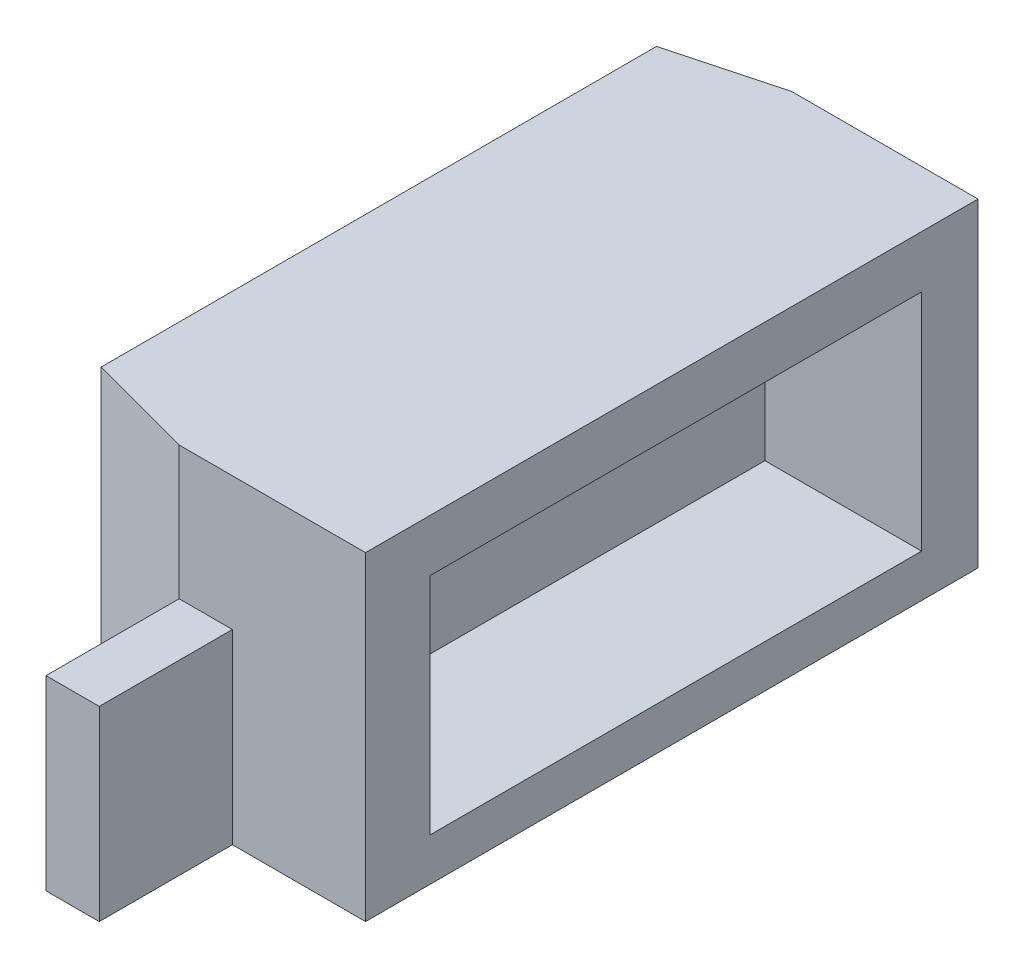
ISO-10303-21;
HEADER;
FILE_DESCRIPTION(('STEP AP214'),'2;1');
FILE_NAME('part.step','',(''),(''),'','','');
FILE_SCHEMA(('AUTOMOTIVE_DESIGN { 1 0 10303 214 1 1 1 1 }'));
ENDSEC;
DATA;
#1=APPLICATION_CONTEXT('core data for automotive mechanical design processes');
#2=APPLICATION_PROTOCOL_DEFINITION('international standard','automotive_design',2000,#1);
#3=PRODUCT_CONTEXT('',#1,'mechanical');
#4=PRODUCT('Part','Part','',(#3));
#5=PRODUCT_RELATED_PRODUCT_CATEGORY('part','',(#4));
#6=PRODUCT_DEFINITION_FORMATION('','',#4);
#7=PRODUCT_DEFINITION_CONTEXT('part definition',#1,'design');
#8=PRODUCT_DEFINITION('design','',#6,#7);
#9=PRODUCT_DEFINITION_SHAPE('','',#8);
#10=(LENGTH_UNIT() NAMED_UNIT(*) SI_UNIT(.MILLI.,.METRE.));
#11=(NAMED_UNIT(*) PLANE_ANGLE_UNIT() SI_UNIT($,.RADIAN.));
#12=(NAMED_UNIT(*) SI_UNIT($,.STERADIAN.) SOLID_ANGLE_UNIT());
#13=UNCERTAINTY_MEASURE_WITH_UNIT(LENGTH_MEASURE(1.E-05),#10,'distance_accuracy_value','');
#14=(GEOMETRIC_REPRESENTATION_CONTEXT(3) GLOBAL_UNCERTAINTY_ASSIGNED_CONTEXT((#13)) GLOBAL_UNIT_ASSIGNED_CONTEXT((#10,
#11,#12)) REPRESENTATION_CONTEXT('',''));
#15=CARTESIAN_POINT('',(0.,0.,0.));
#16=DIRECTION('',(0.,0.,1.));
#17=DIRECTION('',(1.,0.,0.));
#18=AXIS2_PLACEMENT_3D('',#15,#16,#17);
#19=CARTESIAN_POINT('',(-0.55,1.2,-1.15));
#20=DIRECTION('',(0.,0.,1.));
#21=DIRECTION('',(1.,0.,0.));
#22=AXIS2_PLACEMENT_3D('',#19,#20,#21);
#23=PLANE('',#22);
#24=DIRECTION('',(-1.,0.,0.));
#25=VECTOR('',#24,1.);
#26=CARTESIAN_POINT('',(-0.15,0.7,-1.15));
#27=LINE('',#26,#25);
#28=CARTESIAN_POINT('',(0.0499999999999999,0.7,-1.15));
#29=VERTEX_POINT('',#28);
#30=CARTESIAN_POINT('',(-0.15,0.7,-1.15));
#31=VERTEX_POINT('',#30);
#32=EDGE_CURVE('E192',#29,#31,#27,.T.);
#33=ORIENTED_EDGE('',*,*,#32,.T.);
#34=DIRECTION('',(0.,1.,0.));
#35=VECTOR('',#34,1.);
#36=CARTESIAN_POINT('',(-0.149999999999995,1.2,-1.15));
#37=LINE('',#36,#35);
#38=CARTESIAN_POINT('',(-0.149999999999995,1.2,-1.15));
#39=VERTEX_POINT('',#38);
#40=EDGE_CURVE('E11',#31,#39,#37,.T.);
#41=ORIENTED_EDGE('',*,*,#40,.T.);
#42=DIRECTION('',(-1.,0.,0.));
#43=VECTOR('',#42,1.);
#44=CARTESIAN_POINT('',(-0.55,1.2,-1.15));
#45=LINE('',#44,#43);
#46=CARTESIAN_POINT('',(0.55,1.2,-1.15));
#47=VERTEX_POINT('',#46);
#48=EDGE_CURVE('E325',#47,#39,#45,.T.);
#49=ORIENTED_EDGE('',*,*,#48,.F.);
#50=DIRECTION('',(0.,-1.,0.));
#51=VECTOR('',#50,1.);
#52=CARTESIAN_POINT('',(0.55,1.2,-1.15));
#53=LINE('',#52,#51);
#54=CARTESIAN_POINT('',(0.55,0.,-1.15));
#55=VERTEX_POINT('',#54);
#56=EDGE_CURVE('E235',#47,#55,#53,.T.);
#57=ORIENTED_EDGE('',*,*,#56,.T.);
#58=DIRECTION('',(-1.,0.,0.));
#59=VECTOR('',#58,1.);
#60=CARTESIAN_POINT('',(-0.55,0.,-1.15));
#61=LINE('',#60,#59);
#62=CARTESIAN_POINT('',(0.0499999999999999,0.,-1.15));
#63=VERTEX_POINT('',#62);
#64=EDGE_CURVE('E291',#55,#63,#61,.T.);
#65=ORIENTED_EDGE('',*,*,#64,.T.);
#66=DIRECTION('',(0.,-1.,0.));
#67=VECTOR('',#66,1.);
#68=CARTESIAN_POINT('',(0.0499999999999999,0.7,-1.15));
#69=LINE('',#68,#67);
#70=EDGE_CURVE('E209',#29,#63,#69,.T.);
#71=ORIENTED_EDGE('',*,*,#70,.F.);
#72=EDGE_LOOP('',(#33,#41,#49,#57,#65,#71));
#73=FACE_BOUND('',#72,.T.);
#74=ADVANCED_FACE('F32',(#73),#23,.F.);
#75=CARTESIAN_POINT('',(-0.55,1.2,1.15));
#76=DIRECTION('',(0.,0.,-1.));
#77=DIRECTION('',(-1.,0.,0.));
#78=AXIS2_PLACEMENT_3D('',#75,#76,#77);
#79=PLANE('',#78);
#80=DIRECTION('',(1.,0.,0.));
#81=VECTOR('',#80,1.);
#82=CARTESIAN_POINT('',(-0.55,1.2,1.15));
#83=LINE('',#82,#81);
#84=CARTESIAN_POINT('',(-0.149999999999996,1.2,1.15));
#85=VERTEX_POINT('',#84);
#86=CARTESIAN_POINT('',(0.55,1.2,1.15));
#87=VERTEX_POINT('',#86);
#88=EDGE_CURVE('E253',#85,#87,#83,.T.);
#89=ORIENTED_EDGE('',*,*,#88,.F.);
#90=DIRECTION('',(0.,-1.,0.));
#91=VECTOR('',#90,1.);
#92=CARTESIAN_POINT('',(-0.149999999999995,1.2,1.15));
#93=LINE('',#92,#91);
#94=CARTESIAN_POINT('',(-0.15,0.7,1.15));
#95=VERTEX_POINT('',#94);
#96=EDGE_CURVE('E231',#85,#95,#93,.T.);
#97=ORIENTED_EDGE('',*,*,#96,.T.);
#98=DIRECTION('',(1.,0.,0.));
#99=VECTOR('',#98,1.);
#100=CARTESIAN_POINT('',(-0.15,0.7,1.15));
#101=LINE('',#100,#99);
#102=CARTESIAN_POINT('',(0.0499999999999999,0.7,1.15));
#103=VERTEX_POINT('',#102);
#104=EDGE_CURVE('E316',#95,#103,#101,.T.);
#105=ORIENTED_EDGE('',*,*,#104,.T.);
#106=DIRECTION('',(0.,-1.,0.));
#107=VECTOR('',#106,1.);
#108=CARTESIAN_POINT('',(0.0499999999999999,0.7,1.15));
#109=LINE('',#108,#107);
#110=CARTESIAN_POINT('',(0.0499999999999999,0.,1.15));
#111=VERTEX_POINT('',#110);
#112=EDGE_CURVE('E273',#103,#111,#109,.T.);
#113=ORIENTED_EDGE('',*,*,#112,.T.);
#114=DIRECTION('',(1.,0.,0.));
#115=VECTOR('',#114,1.);
#116=CARTESIAN_POINT('',(-0.55,0.,1.15));
#117=LINE('',#116,#115);
#118=CARTESIAN_POINT('',(0.55,0.,1.15));
#119=VERTEX_POINT('',#118);
#120=EDGE_CURVE('E300',#111,#119,#117,.T.);
#121=ORIENTED_EDGE('',*,*,#120,.T.);
#122=DIRECTION('',(0.,-1.,0.));
#123=VECTOR('',#122,1.);
#124=CARTESIAN_POINT('',(0.55,1.2,1.15));
#125=LINE('',#124,#123);
#126=EDGE_CURVE('E263',#87,#119,#125,.T.);
#127=ORIENTED_EDGE('',*,*,#126,.F.);
#128=EDGE_LOOP('',(#89,#97,#105,#113,#121,#127));
#129=FACE_BOUND('',#128,.T.);
#130=ADVANCED_FACE('F259',(#129),#79,.F.);
#131=CARTESIAN_POINT('',(0.55,1.2,1.15));
#132=DIRECTION('',(-1.,0.,0.));
#133=DIRECTION('',(0.,0.,1.));
#134=AXIS2_PLACEMENT_3D('',#131,#132,#133);
#135=PLANE('',#134);
#136=DIRECTION('',(0.,0.,-1.));
#137=VECTOR('',#136,1.);
#138=CARTESIAN_POINT('',(0.55,0.160896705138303,0.908093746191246));
#139=LINE('',#138,#137);
#140=CARTESIAN_POINT('',(0.55,0.160896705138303,0.908093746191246));
#141=VERTEX_POINT('',#140);
#142=CARTESIAN_POINT('',(0.55,0.160896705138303,-0.93803090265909));
#143=VERTEX_POINT('',#142);
#144=EDGE_CURVE('E168',#141,#143,#139,.T.);
#145=ORIENTED_EDGE('',*,*,#144,.F.);
#146=DIRECTION('',(0.,-1.,0.));
#147=VECTOR('',#146,1.);
#148=CARTESIAN_POINT('',(0.55,1.00412661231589,0.908093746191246));
#149=LINE('',#148,#147);
#150=CARTESIAN_POINT('',(0.55,1.00412661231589,0.908093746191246));
#151=VERTEX_POINT('',#150);
#152=EDGE_CURVE('E172',#151,#141,#149,.T.);
#153=ORIENTED_EDGE('',*,*,#152,.F.);
#154=DIRECTION('',(0.,0.,1.));
#155=VECTOR('',#154,1.);
#156=CARTESIAN_POINT('',(0.55,1.00412661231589,0.908093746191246));
#157=LINE('',#156,#155);
#158=CARTESIAN_POINT('',(0.55,1.00412661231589,-0.93803090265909));
#159=VERTEX_POINT('',#158);
#160=EDGE_CURVE('E177',#159,#151,#157,.T.);
#161=ORIENTED_EDGE('',*,*,#160,.F.);
#162=DIRECTION('',(0.,1.,0.));
#163=VECTOR('',#162,1.);
#164=CARTESIAN_POINT('',(0.55,1.00412661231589,-0.93803090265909));
#165=LINE('',#164,#163);
#166=EDGE_CURVE('E156',#143,#159,#165,.T.);
#167=ORIENTED_EDGE('',*,*,#166,.F.);
#168=EDGE_LOOP('',(#145,#153,#161,#167));
#169=FACE_BOUND('',#168,.T.);
#170=DIRECTION('',(0.,0.,-1.));
#171=VECTOR('',#170,1.);
#172=CARTESIAN_POINT('',(0.55,0.,1.15));
#173=LINE('',#172,#171);
#174=EDGE_CURVE('E295',#119,#55,#173,.T.);
#175=ORIENTED_EDGE('',*,*,#174,.T.);
#176=ORIENTED_EDGE('',*,*,#56,.F.);
#177=DIRECTION('',(0.,0.,-1.));
#178=VECTOR('',#177,1.);
#179=CARTESIAN_POINT('',(0.55,1.2,1.15));
#180=LINE('',#179,#178);
#181=EDGE_CURVE('E306',#87,#47,#180,.T.);
#182=ORIENTED_EDGE('',*,*,#181,.F.);
#183=ORIENTED_EDGE('',*,*,#126,.T.);
#184=EDGE_LOOP('',(#175,#176,#182,#183));
#185=FACE_BOUND('',#184,.T.);
#186=ADVANCED_FACE('F174',(#169,#185),#135,.F.);
#187=CARTESIAN_POINT('',(-0.55,1.2,1.15));
#188=DIRECTION('',(1.,0.,0.));
#189=DIRECTION('',(0.,0.,-1.));
#190=AXIS2_PLACEMENT_3D('',#187,#188,#189);
#191=PLANE('',#190);
#192=DIRECTION('',(0.,0.,1.));
#193=VECTOR('',#192,1.);
#194=CARTESIAN_POINT('',(-0.55,0.,1.15));
#195=LINE('',#194,#193);
#196=CARTESIAN_POINT('',(-0.55,0.,-1.04282032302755));
#197=VERTEX_POINT('',#196);
#198=CARTESIAN_POINT('',(-0.55,0.,1.04282032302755));
#199=VERTEX_POINT('',#198);
#200=EDGE_CURVE('E294',#197,#199,#195,.T.);
#201=ORIENTED_EDGE('',*,*,#200,.T.);
#202=DIRECTION('',(0.,1.,0.));
#203=VECTOR('',#202,1.);
#204=CARTESIAN_POINT('',(-0.55,1.2,1.04282032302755));
#205=LINE('',#204,#203);
#206=CARTESIAN_POINT('',(-0.55,1.2,1.04282032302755));
#207=VERTEX_POINT('',#206);
#208=EDGE_CURVE('E53',#199,#207,#205,.T.);
#209=ORIENTED_EDGE('',*,*,#208,.T.);
#210=DIRECTION('',(0.,0.,1.));
#211=VECTOR('',#210,1.);
#212=CARTESIAN_POINT('',(-0.55,1.2,1.15));
#213=LINE('',#212,#211);
#214=CARTESIAN_POINT('',(-0.55,1.2,-1.04282032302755));
#215=VERTEX_POINT('',#214);
#216=EDGE_CURVE('E255',#215,#207,#213,.T.);
#217=ORIENTED_EDGE('',*,*,#216,.F.);
#218=DIRECTION('',(0.,-1.,0.));
#219=VECTOR('',#218,1.);
#220=CARTESIAN_POINT('',(-0.55,1.2,-1.04282032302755));
#221=LINE('',#220,#219);
#222=EDGE_CURVE('E241',#215,#197,#221,.T.);
#223=ORIENTED_EDGE('',*,*,#222,.T.);
#224=EDGE_LOOP('',(#201,#209,#217,#223));
#225=FACE_BOUND('',#224,.T.);
#226=ADVANCED_FACE('F333',(#225),#191,.F.);
#227=CARTESIAN_POINT('',(0.55,1.2,-1.15));
#228=DIRECTION('',(0.,-1.,0.));
#229=DIRECTION('',(0.,0.,-1.));
#230=AXIS2_PLACEMENT_3D('',#227,#228,#229);
#231=PLANE('',#230);
#232=ORIENTED_EDGE('',*,*,#216,.T.);
#233=DIRECTION('',(-0.965925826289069,0.,-0.258819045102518));
#234=VECTOR('',#233,1.);
#235=CARTESIAN_POINT('',(-0.149999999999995,1.2,1.15));
#236=LINE('',#235,#234);
#237=EDGE_CURVE('E40',#207,#85,#236,.F.);
#238=ORIENTED_EDGE('',*,*,#237,.T.);
#239=ORIENTED_EDGE('',*,*,#88,.T.);
#240=ORIENTED_EDGE('',*,*,#181,.T.);
#241=ORIENTED_EDGE('',*,*,#48,.T.);
#242=DIRECTION('',(0.965925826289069,0.,-0.258819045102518));
#243=VECTOR('',#242,1.);
#244=CARTESIAN_POINT('',(-0.55,1.2,-1.04282032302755));
#245=LINE('',#244,#243);
#246=EDGE_CURVE('E247',#39,#215,#245,.F.);
#247=ORIENTED_EDGE('',*,*,#246,.T.);
#248=EDGE_LOOP('',(#232,#238,#239,#240,#241,#247));
#249=FACE_BOUND('',#248,.T.);
#250=ADVANCED_FACE('F251',(#249),#231,.F.);
#251=CARTESIAN_POINT('',(0.55,0.,-1.15));
#252=DIRECTION('',(0.,-1.,0.));
#253=DIRECTION('',(0.,0.,-1.));
#254=AXIS2_PLACEMENT_3D('',#251,#252,#253);
#255=PLANE('',#254);
#256=DIRECTION('',(0.,0.,-1.));
#257=VECTOR('',#256,1.);
#258=CARTESIAN_POINT('',(-0.15,0.,1.15));
#259=LINE('',#258,#257);
#260=CARTESIAN_POINT('',(-0.15,0.,1.65));
#261=VERTEX_POINT('',#260);
#262=CARTESIAN_POINT('',(-0.15,0.,1.15));
#263=VERTEX_POINT('',#262);
#264=EDGE_CURVE('E208',#261,#263,#259,.T.);
#265=ORIENTED_EDGE('',*,*,#264,.T.);
#266=DIRECTION('',(0.965925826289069,0.,0.258819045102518));
#267=VECTOR('',#266,1.);
#268=CARTESIAN_POINT('',(-0.0718911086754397,0.,1.17092921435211));
#269=LINE('',#268,#267);
#270=EDGE_CURVE('E237',#263,#199,#269,.F.);
#271=ORIENTED_EDGE('',*,*,#270,.T.);
#272=ORIENTED_EDGE('',*,*,#200,.F.);
#273=DIRECTION('',(-0.965925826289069,0.,0.258819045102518));
#274=VECTOR('',#273,1.);
#275=CARTESIAN_POINT('',(0.503108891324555,0.,-1.325));
#276=LINE('',#275,#274);
#277=CARTESIAN_POINT('',(-0.15,0.,-1.15));
#278=VERTEX_POINT('',#277);
#279=EDGE_CURVE('E234',#197,#278,#276,.F.);
#280=ORIENTED_EDGE('',*,*,#279,.T.);
#281=DIRECTION('',(0.,0.,-1.));
#282=VECTOR('',#281,1.);
#283=CARTESIAN_POINT('',(-0.15,0.,-1.15));
#284=LINE('',#283,#282);
#285=CARTESIAN_POINT('',(-0.15,0.,-1.65));
#286=VERTEX_POINT('',#285);
#287=EDGE_CURVE('E198',#278,#286,#284,.T.);
#288=ORIENTED_EDGE('',*,*,#287,.T.);
#289=DIRECTION('',(1.,0.,0.));
#290=VECTOR('',#289,1.);
#291=CARTESIAN_POINT('',(-0.15,0.,-1.65));
#292=LINE('',#291,#290);
#293=CARTESIAN_POINT('',(0.05,0.,-1.65));
#294=VERTEX_POINT('',#293);
#295=EDGE_CURVE('E195',#286,#294,#292,.T.);
#296=ORIENTED_EDGE('',*,*,#295,.T.);
#297=DIRECTION('',(0.,0.,1.));
#298=VECTOR('',#297,1.);
#299=CARTESIAN_POINT('',(0.0499999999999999,0.,-1.15));
#300=LINE('',#299,#298);
#301=EDGE_CURVE('E187',#294,#63,#300,.T.);
#302=ORIENTED_EDGE('',*,*,#301,.T.);
#303=ORIENTED_EDGE('',*,*,#64,.F.);
#304=ORIENTED_EDGE('',*,*,#174,.F.);
#305=ORIENTED_EDGE('',*,*,#120,.F.);
#306=DIRECTION('',(0.,0.,1.));
#307=VECTOR('',#306,1.);
#308=CARTESIAN_POINT('',(0.0499999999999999,0.,1.15));
#309=LINE('',#308,#307);
#310=CARTESIAN_POINT('',(0.0499999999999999,0.,1.65));
#311=VERTEX_POINT('',#310);
#312=EDGE_CURVE('E288',#111,#311,#309,.T.);
#313=ORIENTED_EDGE('',*,*,#312,.T.);
#314=DIRECTION('',(-1.,0.,0.));
#315=VECTOR('',#314,1.);
#316=CARTESIAN_POINT('',(-0.15,0.,1.65));
#317=LINE('',#316,#315);
#318=EDGE_CURVE('E308',#311,#261,#317,.T.);
#319=ORIENTED_EDGE('',*,*,#318,.T.);
#320=EDGE_LOOP('',(#265,#271,#272,#280,#288,#296,#302,#303,#304,#305,#313,#319));
#321=FACE_BOUND('',#320,.T.);
#322=ADVANCED_FACE('F334',(#321),#255,.T.);
#323=CARTESIAN_POINT('',(-0.15,0.7,1.15));
#324=DIRECTION('',(-1.,0.,0.));
#325=DIRECTION('',(0.,0.,1.));
#326=AXIS2_PLACEMENT_3D('',#323,#324,#325);
#327=PLANE('',#326);
#328=ORIENTED_EDGE('',*,*,#264,.F.);
#329=DIRECTION('',(0.,-1.,0.));
#330=VECTOR('',#329,1.);
#331=CARTESIAN_POINT('',(-0.15,0.7,1.65));
#332=LINE('',#331,#330);
#333=CARTESIAN_POINT('',(-0.15,0.7,1.65));
#334=VERTEX_POINT('',#333);
#335=EDGE_CURVE('E320',#334,#261,#332,.T.);
#336=ORIENTED_EDGE('',*,*,#335,.F.);
#337=DIRECTION('',(0.,0.,-1.));
#338=VECTOR('',#337,1.);
#339=CARTESIAN_POINT('',(-0.15,0.7,1.15));
#340=LINE('',#339,#338);
#341=EDGE_CURVE('E314',#334,#95,#340,.T.);
#342=ORIENTED_EDGE('',*,*,#341,.T.);
#343=DIRECTION('',(0.,-1.,0.));
#344=VECTOR('',#343,1.);
#345=CARTESIAN_POINT('',(-0.15,0.7,1.15));
#346=LINE('',#345,#344);
#347=EDGE_CURVE('E268',#95,#263,#346,.T.);
#348=ORIENTED_EDGE('',*,*,#347,.T.);
#349=EDGE_LOOP('',(#328,#336,#342,#348));
#350=FACE_BOUND('',#349,.T.);
#351=ADVANCED_FACE('F337',(#350),#327,.T.);
#352=CARTESIAN_POINT('',(-0.15,0.7,1.65));
#353=DIRECTION('',(0.,0.,1.));
#354=DIRECTION('',(1.,0.,0.));
#355=AXIS2_PLACEMENT_3D('',#352,#353,#354);
#356=PLANE('',#355);
#357=ORIENTED_EDGE('',*,*,#318,.F.);
#358=DIRECTION('',(0.,-1.,0.));
#359=VECTOR('',#358,1.);
#360=CARTESIAN_POINT('',(0.0499999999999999,0.7,1.65));
#361=LINE('',#360,#359);
#362=CARTESIAN_POINT('',(0.0499999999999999,0.7,1.65));
#363=VERTEX_POINT('',#362);
#364=EDGE_CURVE('E277',#363,#311,#361,.T.);
#365=ORIENTED_EDGE('',*,*,#364,.F.);
#366=DIRECTION('',(-1.,0.,0.));
#367=VECTOR('',#366,1.);
#368=CARTESIAN_POINT('',(-0.15,0.7,1.65));
#369=LINE('',#368,#367);
#370=EDGE_CURVE('E274',#363,#334,#369,.T.);
#371=ORIENTED_EDGE('',*,*,#370,.T.);
#372=ORIENTED_EDGE('',*,*,#335,.T.);
#373=EDGE_LOOP('',(#357,#365,#371,#372));
#374=FACE_BOUND('',#373,.T.);
#375=ADVANCED_FACE('F344',(#374),#356,.T.);
#376=CARTESIAN_POINT('',(0.0499999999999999,0.7,1.15));
#377=DIRECTION('',(1.,0.,0.));
#378=DIRECTION('',(0.,0.,-1.));
#379=AXIS2_PLACEMENT_3D('',#376,#377,#378);
#380=PLANE('',#379);
#381=ORIENTED_EDGE('',*,*,#312,.F.);
#382=ORIENTED_EDGE('',*,*,#112,.F.);
#383=DIRECTION('',(0.,0.,1.));
#384=VECTOR('',#383,1.);
#385=CARTESIAN_POINT('',(0.0499999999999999,0.7,1.15));
#386=LINE('',#385,#384);
#387=EDGE_CURVE('E280',#103,#363,#386,.T.);
#388=ORIENTED_EDGE('',*,*,#387,.T.);
#389=ORIENTED_EDGE('',*,*,#364,.T.);
#390=EDGE_LOOP('',(#381,#382,#388,#389));
#391=FACE_BOUND('',#390,.T.);
#392=ADVANCED_FACE('F347',(#391),#380,.T.);
#393=CARTESIAN_POINT('',(-0.15,0.7,1.65));
#394=DIRECTION('',(0.,1.,0.));
#395=DIRECTION('',(0.,0.,1.));
#396=AXIS2_PLACEMENT_3D('',#393,#394,#395);
#397=PLANE('',#396);
#398=ORIENTED_EDGE('',*,*,#341,.F.);
#399=ORIENTED_EDGE('',*,*,#370,.F.);
#400=ORIENTED_EDGE('',*,*,#387,.F.);
#401=ORIENTED_EDGE('',*,*,#104,.F.);
#402=EDGE_LOOP('',(#398,#399,#400,#401));
#403=FACE_BOUND('',#402,.T.);
#404=ADVANCED_FACE('F342',(#403),#397,.T.);
#405=CARTESIAN_POINT('',(-0.15,0.7,-1.15));
#406=DIRECTION('',(-1.,0.,0.));
#407=DIRECTION('',(0.,0.,1.));
#408=AXIS2_PLACEMENT_3D('',#405,#406,#407);
#409=PLANE('',#408);
#410=ORIENTED_EDGE('',*,*,#287,.F.);
#411=DIRECTION('',(0.,-1.,0.));
#412=VECTOR('',#411,1.);
#413=CARTESIAN_POINT('',(-0.15,0.7,-1.15));
#414=LINE('',#413,#412);
#415=EDGE_CURVE('E204',#31,#278,#414,.T.);
#416=ORIENTED_EDGE('',*,*,#415,.F.);
#417=DIRECTION('',(0.,0.,-1.));
#418=VECTOR('',#417,1.);
#419=CARTESIAN_POINT('',(-0.15,0.7,-1.15));
#420=LINE('',#419,#418);
#421=CARTESIAN_POINT('',(-0.15,0.7,-1.65));
#422=VERTEX_POINT('',#421);
#423=EDGE_CURVE('E183',#31,#422,#420,.T.);
#424=ORIENTED_EDGE('',*,*,#423,.T.);
#425=DIRECTION('',(0.,-1.,0.));
#426=VECTOR('',#425,1.);
#427=CARTESIAN_POINT('',(-0.15,0.7,-1.65));
#428=LINE('',#427,#426);
#429=EDGE_CURVE('E194',#422,#286,#428,.T.);
#430=ORIENTED_EDGE('',*,*,#429,.T.);
#431=EDGE_LOOP('',(#410,#416,#424,#430));
#432=FACE_BOUND('',#431,.T.);
#433=ADVANCED_FACE('F359',(#432),#409,.T.);
#434=CARTESIAN_POINT('',(0.0499999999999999,0.7,-1.15));
#435=DIRECTION('',(1.,0.,0.));
#436=DIRECTION('',(0.,0.,-1.));
#437=AXIS2_PLACEMENT_3D('',#434,#435,#436);
#438=PLANE('',#437);
#439=ORIENTED_EDGE('',*,*,#301,.F.);
#440=DIRECTION('',(0.,-1.,0.));
#441=VECTOR('',#440,1.);
#442=CARTESIAN_POINT('',(0.05,0.7,-1.65));
#443=LINE('',#442,#441);
#444=CARTESIAN_POINT('',(0.05,0.7,-1.65));
#445=VERTEX_POINT('',#444);
#446=EDGE_CURVE('E201',#445,#294,#443,.T.);
#447=ORIENTED_EDGE('',*,*,#446,.F.);
#448=DIRECTION('',(0.,0.,1.));
#449=VECTOR('',#448,1.);
#450=CARTESIAN_POINT('',(0.0499999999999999,0.7,-1.15));
#451=LINE('',#450,#449);
#452=EDGE_CURVE('E190',#445,#29,#451,.T.);
#453=ORIENTED_EDGE('',*,*,#452,.T.);
#454=ORIENTED_EDGE('',*,*,#70,.T.);
#455=EDGE_LOOP('',(#439,#447,#453,#454));
#456=FACE_BOUND('',#455,.T.);
#457=ADVANCED_FACE('F357',(#456),#438,.T.);
#458=CARTESIAN_POINT('',(-0.15,0.7,-1.65));
#459=DIRECTION('',(0.,0.,-1.));
#460=DIRECTION('',(-1.,0.,0.));
#461=AXIS2_PLACEMENT_3D('',#458,#459,#460);
#462=PLANE('',#461);
#463=ORIENTED_EDGE('',*,*,#295,.F.);
#464=ORIENTED_EDGE('',*,*,#429,.F.);
#465=DIRECTION('',(1.,0.,0.));
#466=VECTOR('',#465,1.);
#467=CARTESIAN_POINT('',(-0.15,0.7,-1.65));
#468=LINE('',#467,#466);
#469=EDGE_CURVE('E186',#422,#445,#468,.T.);
#470=ORIENTED_EDGE('',*,*,#469,.T.);
#471=ORIENTED_EDGE('',*,*,#446,.T.);
#472=EDGE_LOOP('',(#463,#464,#470,#471));
#473=FACE_BOUND('',#472,.T.);
#474=ADVANCED_FACE('F353',(#473),#462,.T.);
#475=CARTESIAN_POINT('',(-0.15,0.7,-1.65));
#476=DIRECTION('',(0.,-1.,0.));
#477=DIRECTION('',(0.,0.,-1.));
#478=AXIS2_PLACEMENT_3D('',#475,#476,#477);
#479=PLANE('',#478);
#480=ORIENTED_EDGE('',*,*,#423,.F.);
#481=ORIENTED_EDGE('',*,*,#32,.F.);
#482=ORIENTED_EDGE('',*,*,#452,.F.);
#483=ORIENTED_EDGE('',*,*,#469,.F.);
#484=EDGE_LOOP('',(#480,#481,#482,#483));
#485=FACE_BOUND('',#484,.T.);
#486=ADVANCED_FACE('F363',(#485),#479,.F.);
#487=CARTESIAN_POINT('',(0.55,1.00412661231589,0.908093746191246));
#488=DIRECTION('',(0.17364817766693,0.,-0.984807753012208));
#489=DIRECTION('',(-0.984807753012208,0.,-0.17364817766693));
#490=AXIS2_PLACEMENT_3D('',#487,#488,#489);
#491=PLANE('',#490);
#492=ORIENTED_EDGE('',*,*,#152,.T.);
#493=DIRECTION('',(0.970287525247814,-0.171087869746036,0.171087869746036));
#494=VECTOR('',#493,1.);
#495=CARTESIAN_POINT('',(0.410020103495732,0.185578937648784,0.883411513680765));
#496=LINE('',#495,#494);
#497=CARTESIAN_POINT('',(0.0500000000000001,0.249060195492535,0.819930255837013));
#498=VERTEX_POINT('',#497);
#499=EDGE_CURVE('E164',#498,#141,#496,.T.);
#500=ORIENTED_EDGE('',*,*,#499,.F.);
#501=DIRECTION('',(0.,1.,0.));
#502=VECTOR('',#501,1.);
#503=CARTESIAN_POINT('',(0.0500000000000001,0.160896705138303,0.819930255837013));
#504=LINE('',#503,#502);
#505=CARTESIAN_POINT('',(0.0500000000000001,0.915963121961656,0.819930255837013));
#506=VERTEX_POINT('',#505);
#507=EDGE_CURVE('E179',#506,#498,#504,.F.);
#508=ORIENTED_EDGE('',*,*,#507,.F.);
#509=DIRECTION('',(0.970287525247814,0.171087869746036,0.171087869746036));
#510=VECTOR('',#509,1.);
#511=CARTESIAN_POINT('',(0.55,1.00412661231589,0.908093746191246));
#512=LINE('',#511,#510);
#513=EDGE_CURVE('E221',#506,#151,#512,.T.);
#514=ORIENTED_EDGE('',*,*,#513,.T.);
#515=EDGE_LOOP('',(#492,#500,#508,#514));
#516=FACE_BOUND('',#515,.T.);
#517=ADVANCED_FACE('F400',(#516),#491,.T.);
#518=CARTESIAN_POINT('',(0.55,1.00412661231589,0.908093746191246));
#519=DIRECTION('',(0.17364817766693,-0.984807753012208,0.));
#520=DIRECTION('',(0.984807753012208,0.17364817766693,0.));
#521=AXIS2_PLACEMENT_3D('',#518,#519,#520);
#522=PLANE('',#521);
#523=ORIENTED_EDGE('',*,*,#160,.T.);
#524=ORIENTED_EDGE('',*,*,#513,.F.);
#525=DIRECTION('',(0.,0.,-1.));
#526=VECTOR('',#525,1.);
#527=CARTESIAN_POINT('',(0.0500000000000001,0.915963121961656,0.908093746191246));
#528=LINE('',#527,#526);
#529=CARTESIAN_POINT('',(0.0500000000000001,0.915963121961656,-0.849867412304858));
#530=VERTEX_POINT('',#529);
#531=EDGE_CURVE('E220',#530,#506,#528,.F.);
#532=ORIENTED_EDGE('',*,*,#531,.F.);
#533=DIRECTION('',(0.970287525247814,0.171087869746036,-0.171087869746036));
#534=VECTOR('',#533,1.);
#535=CARTESIAN_POINT('',(0.55,1.00412661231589,-0.93803090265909));
#536=LINE('',#535,#534);
#537=EDGE_CURVE('E163',#530,#159,#536,.T.);
#538=ORIENTED_EDGE('',*,*,#537,.T.);
#539=EDGE_LOOP('',(#523,#524,#532,#538));
#540=FACE_BOUND('',#539,.T.);
#541=ADVANCED_FACE('F412',(#540),#522,.T.);
#542=CARTESIAN_POINT('',(0.55,1.00412661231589,-0.93803090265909));
#543=DIRECTION('',(0.17364817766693,0.,0.984807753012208));
#544=DIRECTION('',(0.984807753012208,0.,-0.17364817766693));
#545=AXIS2_PLACEMENT_3D('',#542,#543,#544);
#546=PLANE('',#545);
#547=ORIENTED_EDGE('',*,*,#166,.T.);
#548=ORIENTED_EDGE('',*,*,#537,.F.);
#549=DIRECTION('',(0.,-1.,0.));
#550=VECTOR('',#549,1.);
#551=CARTESIAN_POINT('',(0.0500000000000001,0.160896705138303,-0.849867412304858));
#552=LINE('',#551,#550);
#553=CARTESIAN_POINT('',(0.0500000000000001,0.249060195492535,-0.849867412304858));
#554=VERTEX_POINT('',#553);
#555=EDGE_CURVE('E159',#554,#530,#552,.F.);
#556=ORIENTED_EDGE('',*,*,#555,.F.);
#557=DIRECTION('',(0.970287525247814,-0.171087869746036,-0.171087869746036));
#558=VECTOR('',#557,1.);
#559=CARTESIAN_POINT('',(0.243535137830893,0.214934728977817,-0.883992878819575));
#560=LINE('',#559,#558);
#561=EDGE_CURVE('E152',#554,#143,#560,.T.);
#562=ORIENTED_EDGE('',*,*,#561,.T.);
#563=EDGE_LOOP('',(#547,#548,#556,#562));
#564=FACE_BOUND('',#563,.T.);
#565=ADVANCED_FACE('F154',(#564),#546,.T.);
#566=CARTESIAN_POINT('',(0.55,0.160896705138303,0.908093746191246));
#567=DIRECTION('',(0.17364817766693,0.984807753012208,0.));
#568=DIRECTION('',(-0.984807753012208,0.17364817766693,0.));
#569=AXIS2_PLACEMENT_3D('',#566,#567,#568);
#570=PLANE('',#569);
#571=ORIENTED_EDGE('',*,*,#144,.T.);
#572=ORIENTED_EDGE('',*,*,#561,.F.);
#573=DIRECTION('',(0.,0.,1.));
#574=VECTOR('',#573,1.);
#575=CARTESIAN_POINT('',(0.0500000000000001,0.249060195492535,0.908093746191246));
#576=LINE('',#575,#574);
#577=EDGE_CURVE('E224',#498,#554,#576,.F.);
#578=ORIENTED_EDGE('',*,*,#577,.F.);
#579=ORIENTED_EDGE('',*,*,#499,.T.);
#580=EDGE_LOOP('',(#571,#572,#578,#579));
#581=FACE_BOUND('',#580,.T.);
#582=ADVANCED_FACE('F169',(#581),#570,.T.);
#583=CARTESIAN_POINT('',(0.0500000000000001,0.160896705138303,0.908093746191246));
#584=DIRECTION('',(1.,0.,0.));
#585=DIRECTION('',(0.,0.,-1.));
#586=AXIS2_PLACEMENT_3D('',#583,#584,#585);
#587=PLANE('',#586);
#588=ORIENTED_EDGE('',*,*,#507,.T.);
#589=ORIENTED_EDGE('',*,*,#577,.T.);
#590=ORIENTED_EDGE('',*,*,#555,.T.);
#591=ORIENTED_EDGE('',*,*,#531,.T.);
#592=EDGE_LOOP('',(#588,#589,#590,#591));
#593=FACE_BOUND('',#592,.T.);
#594=ADVANCED_FACE('F401',(#593),#587,.T.);
#595=CARTESIAN_POINT('',(-0.149999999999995,1.2,1.15));
#596=DIRECTION('',(0.258819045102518,0.,-0.965925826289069));
#597=DIRECTION('',(-0.965925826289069,0.,-0.258819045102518));
#598=AXIS2_PLACEMENT_3D('',#595,#596,#597);
#599=PLANE('',#598);
#600=ORIENTED_EDGE('',*,*,#237,.F.);
#601=ORIENTED_EDGE('',*,*,#208,.F.);
#602=ORIENTED_EDGE('',*,*,#270,.F.);
#603=ORIENTED_EDGE('',*,*,#347,.F.);
#604=ORIENTED_EDGE('',*,*,#96,.F.);
#605=EDGE_LOOP('',(#600,#601,#602,#603,#604));
#606=FACE_BOUND('',#605,.T.);
#607=ADVANCED_FACE('F266',(#606),#599,.F.);
#608=CARTESIAN_POINT('',(-0.55,1.2,-1.04282032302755));
#609=DIRECTION('',(0.258819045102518,0.,0.965925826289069));
#610=DIRECTION('',(0.965925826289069,0.,-0.258819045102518));
#611=AXIS2_PLACEMENT_3D('',#608,#609,#610);
#612=PLANE('',#611);
#613=ORIENTED_EDGE('',*,*,#40,.F.);
#614=ORIENTED_EDGE('',*,*,#415,.T.);
#615=ORIENTED_EDGE('',*,*,#279,.F.);
#616=ORIENTED_EDGE('',*,*,#222,.F.);
#617=ORIENTED_EDGE('',*,*,#246,.F.);
#618=EDGE_LOOP('',(#613,#614,#615,#616,#617));
#619=FACE_BOUND('',#618,.T.);
#620=ADVANCED_FACE('F34',(#619),#612,.F.);
#621=CLOSED_SHELL('',(#74,#130,#186,#226,#250,#322,#351,#375,#392,#404,#433,#457,#474,#486,#517,
#541,#565,#582,#594,#607,#620));
#622=MANIFOLD_SOLID_BREP('B2',#621);
#623=ADVANCED_BREP_SHAPE_REPRESENTATION('',(#18,#622),#14);
#624=SHAPE_DEFINITION_REPRESENTATION(#9,#623);
ENDSEC;
END-ISO-10303-21;
